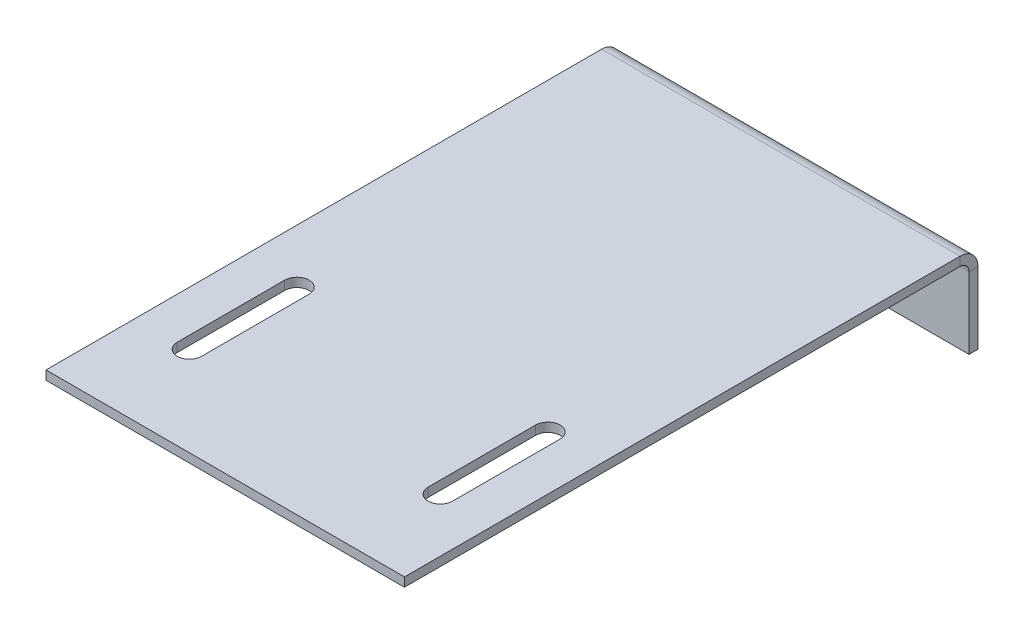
ISO-10303-21;
HEADER;
FILE_DESCRIPTION(('STEP AP214'),'2;1');
FILE_NAME('part.step','',(''),(''),'','','');
FILE_SCHEMA(('AUTOMOTIVE_DESIGN { 1 0 10303 214 1 1 1 1 }'));
ENDSEC;
DATA;
#1=APPLICATION_CONTEXT('core data for automotive mechanical design processes');
#2=APPLICATION_PROTOCOL_DEFINITION('international standard','automotive_design',2000,#1);
#3=PRODUCT_CONTEXT('',#1,'mechanical');
#4=PRODUCT('Part','Part','',(#3));
#5=PRODUCT_RELATED_PRODUCT_CATEGORY('part','',(#4));
#6=PRODUCT_DEFINITION_FORMATION('','',#4);
#7=PRODUCT_DEFINITION_CONTEXT('part definition',#1,'design');
#8=PRODUCT_DEFINITION('design','',#6,#7);
#9=PRODUCT_DEFINITION_SHAPE('','',#8);
#10=(LENGTH_UNIT() NAMED_UNIT(*) SI_UNIT(.MILLI.,.METRE.));
#11=(NAMED_UNIT(*) PLANE_ANGLE_UNIT() SI_UNIT($,.RADIAN.));
#12=(NAMED_UNIT(*) SI_UNIT($,.STERADIAN.) SOLID_ANGLE_UNIT());
#13=UNCERTAINTY_MEASURE_WITH_UNIT(LENGTH_MEASURE(1.E-05),#10,'distance_accuracy_value','');
#14=(GEOMETRIC_REPRESENTATION_CONTEXT(3) GLOBAL_UNCERTAINTY_ASSIGNED_CONTEXT((#13)) GLOBAL_UNIT_ASSIGNED_CONTEXT((#10,
#11,#12)) REPRESENTATION_CONTEXT('',''));
#15=CARTESIAN_POINT('',(0.,0.,0.));
#16=DIRECTION('',(0.,0.,1.));
#17=DIRECTION('',(1.,0.,0.));
#18=AXIS2_PLACEMENT_3D('',#15,#16,#17);
#19=CARTESIAN_POINT('',(50.,-5.,-160.));
#20=DIRECTION('',(1.,0.,0.));
#21=DIRECTION('',(0.,0.,-1.));
#22=AXIS2_PLACEMENT_3D('',#19,#20,#21);
#23=PLANE('',#22);
#24=DIRECTION('',(0.,0.,1.));
#25=VECTOR('',#24,1.);
#26=CARTESIAN_POINT('',(50.,-5.,-160.));
#27=LINE('',#26,#25);
#28=CARTESIAN_POINT('',(50.,-5.,-160.));
#29=VERTEX_POINT('',#28);
#30=CARTESIAN_POINT('',(50.,-5.,-157.5));
#31=VERTEX_POINT('',#30);
#32=EDGE_CURVE('E318',#29,#31,#27,.T.);
#33=ORIENTED_EDGE('',*,*,#32,.F.);
#34=CARTESIAN_POINT('',(50.,-5.,-155.));
#35=DIRECTION('',(1.,0.,0.));
#36=DIRECTION('',(0.,0.,-1.));
#37=AXIS2_PLACEMENT_3D('',#34,#35,#36);
#38=CIRCLE('',#37,5.);
#39=CARTESIAN_POINT('',(50.,0.,-155.));
#40=VERTEX_POINT('',#39);
#41=EDGE_CURVE('E262',#40,#29,#38,.F.);
#42=ORIENTED_EDGE('',*,*,#41,.F.);
#43=DIRECTION('',(0.,1.,0.));
#44=VECTOR('',#43,1.);
#45=CARTESIAN_POINT('',(50.,-2.50000000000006,-155.));
#46=LINE('',#45,#44);
#47=CARTESIAN_POINT('',(50.,-2.50000000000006,-155.));
#48=VERTEX_POINT('',#47);
#49=EDGE_CURVE('E315',#48,#40,#46,.T.);
#50=ORIENTED_EDGE('',*,*,#49,.F.);
#51=CARTESIAN_POINT('',(50.,-5.,-155.));
#52=DIRECTION('',(1.,0.,0.));
#53=DIRECTION('',(0.,0.,-1.));
#54=AXIS2_PLACEMENT_3D('',#51,#52,#53);
#55=CIRCLE('',#54,2.5);
#56=EDGE_CURVE('E277',#48,#31,#55,.F.);
#57=ORIENTED_EDGE('',*,*,#56,.T.);
#58=EDGE_LOOP('',(#33,#42,#50,#57));
#59=FACE_BOUND('',#58,.T.);
#60=ADVANCED_FACE('F42',(#59),#23,.T.);
#61=CARTESIAN_POINT('',(50.,-2.50000000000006,-155.));
#62=DIRECTION('',(1.,0.,0.));
#63=DIRECTION('',(0.,0.,-1.));
#64=AXIS2_PLACEMENT_3D('',#61,#62,#63);
#65=PLANE('',#64);
#66=DIRECTION('',(0.,-1.,0.));
#67=VECTOR('',#66,1.);
#68=CARTESIAN_POINT('',(50.,0.,-160.));
#69=LINE('',#68,#67);
#70=CARTESIAN_POINT('',(50.,-25.,-160.));
#71=VERTEX_POINT('',#70);
#72=EDGE_CURVE('E258',#29,#71,#69,.T.);
#73=ORIENTED_EDGE('',*,*,#72,.F.);
#74=ORIENTED_EDGE('',*,*,#32,.T.);
#75=DIRECTION('',(0.,1.,0.));
#76=VECTOR('',#75,1.);
#77=CARTESIAN_POINT('',(50.,0.,-157.5));
#78=LINE('',#77,#76);
#79=CARTESIAN_POINT('',(50.,-25.,-157.5));
#80=VERTEX_POINT('',#79);
#81=EDGE_CURVE('E251',#31,#80,#78,.F.);
#82=ORIENTED_EDGE('',*,*,#81,.T.);
#83=DIRECTION('',(0.,0.,1.));
#84=VECTOR('',#83,1.);
#85=CARTESIAN_POINT('',(50.,-25.,-160.));
#86=LINE('',#85,#84);
#87=EDGE_CURVE('E254',#71,#80,#86,.T.);
#88=ORIENTED_EDGE('',*,*,#87,.F.);
#89=EDGE_LOOP('',(#73,#74,#82,#88));
#90=FACE_BOUND('',#89,.T.);
#91=ADVANCED_FACE('F364',(#90),#65,.T.);
#92=CARTESIAN_POINT('',(-50.,0.,-155.));
#93=DIRECTION('',(-1.,0.,0.));
#94=DIRECTION('',(0.,0.,1.));
#95=AXIS2_PLACEMENT_3D('',#92,#93,#94);
#96=PLANE('',#95);
#97=DIRECTION('',(0.,-1.,0.));
#98=VECTOR('',#97,1.);
#99=CARTESIAN_POINT('',(-50.,0.,-155.));
#100=LINE('',#99,#98);
#101=CARTESIAN_POINT('',(-50.,0.,-155.));
#102=VERTEX_POINT('',#101);
#103=CARTESIAN_POINT('',(-50.,-2.50000000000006,-155.));
#104=VERTEX_POINT('',#103);
#105=EDGE_CURVE('E312',#102,#104,#100,.T.);
#106=ORIENTED_EDGE('',*,*,#105,.F.);
#107=CARTESIAN_POINT('',(-50.,-5.,-155.));
#108=DIRECTION('',(1.,0.,0.));
#109=DIRECTION('',(0.,0.,-1.));
#110=AXIS2_PLACEMENT_3D('',#107,#108,#109);
#111=CIRCLE('',#110,5.);
#112=CARTESIAN_POINT('',(-50.,-5.,-160.));
#113=VERTEX_POINT('',#112);
#114=EDGE_CURVE('E231',#102,#113,#111,.F.);
#115=ORIENTED_EDGE('',*,*,#114,.T.);
#116=DIRECTION('',(0.,0.,-1.));
#117=VECTOR('',#116,1.);
#118=CARTESIAN_POINT('',(-50.,-5.,-157.5));
#119=LINE('',#118,#117);
#120=CARTESIAN_POINT('',(-50.,-5.,-157.5));
#121=VERTEX_POINT('',#120);
#122=EDGE_CURVE('E309',#121,#113,#119,.T.);
#123=ORIENTED_EDGE('',*,*,#122,.F.);
#124=CARTESIAN_POINT('',(-50.,-5.,-155.));
#125=DIRECTION('',(1.,0.,0.));
#126=DIRECTION('',(0.,0.,-1.));
#127=AXIS2_PLACEMENT_3D('',#124,#125,#126);
#128=CIRCLE('',#127,2.5);
#129=EDGE_CURVE('E247',#104,#121,#128,.F.);
#130=ORIENTED_EDGE('',*,*,#129,.F.);
#131=EDGE_LOOP('',(#106,#115,#123,#130));
#132=FACE_BOUND('',#131,.T.);
#133=ADVANCED_FACE('F369',(#132),#96,.T.);
#134=CARTESIAN_POINT('',(-50.,-5.,-157.5));
#135=DIRECTION('',(-1.,0.,0.));
#136=DIRECTION('',(0.,0.,1.));
#137=AXIS2_PLACEMENT_3D('',#134,#135,#136);
#138=PLANE('',#137);
#139=DIRECTION('',(0.,0.,-1.));
#140=VECTOR('',#139,1.);
#141=CARTESIAN_POINT('',(-50.,0.,0.));
#142=LINE('',#141,#140);
#143=CARTESIAN_POINT('',(-50.,0.,0.));
#144=VERTEX_POINT('',#143);
#145=EDGE_CURVE('E235',#144,#102,#142,.T.);
#146=ORIENTED_EDGE('',*,*,#145,.T.);
#147=ORIENTED_EDGE('',*,*,#105,.T.);
#148=DIRECTION('',(0.,0.,-1.));
#149=VECTOR('',#148,1.);
#150=CARTESIAN_POINT('',(-50.,-2.50000000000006,0.));
#151=LINE('',#150,#149);
#152=CARTESIAN_POINT('',(-50.,-2.50000000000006,0.));
#153=VERTEX_POINT('',#152);
#154=EDGE_CURVE('E243',#153,#104,#151,.T.);
#155=ORIENTED_EDGE('',*,*,#154,.F.);
#156=DIRECTION('',(0.,1.,0.));
#157=VECTOR('',#156,1.);
#158=CARTESIAN_POINT('',(-50.,-2.50000000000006,0.));
#159=LINE('',#158,#157);
#160=EDGE_CURVE('E239',#153,#144,#159,.T.);
#161=ORIENTED_EDGE('',*,*,#160,.T.);
#162=EDGE_LOOP('',(#146,#147,#155,#161));
#163=FACE_BOUND('',#162,.T.);
#164=ADVANCED_FACE('F412',(#163),#138,.T.);
#165=CARTESIAN_POINT('',(50.,0.,-157.5));
#166=DIRECTION('',(0.,0.,-1.));
#167=DIRECTION('',(-1.,0.,0.));
#168=AXIS2_PLACEMENT_3D('',#165,#166,#167);
#169=PLANE('',#168);
#170=DIRECTION('',(0.,1.,0.));
#171=VECTOR('',#170,1.);
#172=CARTESIAN_POINT('',(-50.,0.,-157.5));
#173=LINE('',#172,#171);
#174=CARTESIAN_POINT('',(-50.,-25.,-157.5));
#175=VERTEX_POINT('',#174);
#176=EDGE_CURVE('E210',#121,#175,#173,.F.);
#177=ORIENTED_EDGE('',*,*,#176,.T.);
#178=DIRECTION('',(-1.,0.,0.));
#179=VECTOR('',#178,1.);
#180=CARTESIAN_POINT('',(50.,-25.,-157.5));
#181=LINE('',#180,#179);
#182=EDGE_CURVE('E306',#80,#175,#181,.T.);
#183=ORIENTED_EDGE('',*,*,#182,.F.);
#184=ORIENTED_EDGE('',*,*,#81,.F.);
#185=DIRECTION('',(-1.,0.,0.));
#186=VECTOR('',#185,1.);
#187=CARTESIAN_POINT('',(50.,-5.,-157.5));
#188=LINE('',#187,#186);
#189=EDGE_CURVE('E281',#31,#121,#188,.T.);
#190=ORIENTED_EDGE('',*,*,#189,.T.);
#191=EDGE_LOOP('',(#177,#183,#184,#190));
#192=FACE_BOUND('',#191,.T.);
#193=ADVANCED_FACE('F404',(#192),#169,.F.);
#194=CARTESIAN_POINT('',(50.,-25.,-160.));
#195=DIRECTION('',(0.,-1.,0.));
#196=DIRECTION('',(0.,0.,-1.));
#197=AXIS2_PLACEMENT_3D('',#194,#195,#196);
#198=PLANE('',#197);
#199=DIRECTION('',(0.,0.,1.));
#200=VECTOR('',#199,1.);
#201=CARTESIAN_POINT('',(-50.,-25.,-160.));
#202=LINE('',#201,#200);
#203=CARTESIAN_POINT('',(-50.,-25.,-160.));
#204=VERTEX_POINT('',#203);
#205=EDGE_CURVE('E223',#204,#175,#202,.T.);
#206=ORIENTED_EDGE('',*,*,#205,.F.);
#207=DIRECTION('',(-1.,0.,0.));
#208=VECTOR('',#207,1.);
#209=CARTESIAN_POINT('',(50.,-25.,-160.));
#210=LINE('',#209,#208);
#211=EDGE_CURVE('E303',#71,#204,#210,.T.);
#212=ORIENTED_EDGE('',*,*,#211,.F.);
#213=ORIENTED_EDGE('',*,*,#87,.T.);
#214=ORIENTED_EDGE('',*,*,#182,.T.);
#215=EDGE_LOOP('',(#206,#212,#213,#214));
#216=FACE_BOUND('',#215,.T.);
#217=ADVANCED_FACE('F407',(#216),#198,.T.);
#218=CARTESIAN_POINT('',(50.,0.,-160.));
#219=DIRECTION('',(0.,0.,-1.));
#220=DIRECTION('',(-1.,0.,0.));
#221=AXIS2_PLACEMENT_3D('',#218,#219,#220);
#222=PLANE('',#221);
#223=DIRECTION('',(0.,-1.,0.));
#224=VECTOR('',#223,1.);
#225=CARTESIAN_POINT('',(-50.,0.,-160.));
#226=LINE('',#225,#224);
#227=EDGE_CURVE('E227',#113,#204,#226,.T.);
#228=ORIENTED_EDGE('',*,*,#227,.F.);
#229=DIRECTION('',(-1.,0.,0.));
#230=VECTOR('',#229,1.);
#231=CARTESIAN_POINT('',(50.,-5.,-160.));
#232=LINE('',#231,#230);
#233=EDGE_CURVE('E299',#29,#113,#232,.T.);
#234=ORIENTED_EDGE('',*,*,#233,.F.);
#235=ORIENTED_EDGE('',*,*,#72,.T.);
#236=ORIENTED_EDGE('',*,*,#211,.T.);
#237=EDGE_LOOP('',(#228,#234,#235,#236));
#238=FACE_BOUND('',#237,.T.);
#239=ADVANCED_FACE('F378',(#238),#222,.T.);
#240=CARTESIAN_POINT('',(50.,-5.,-155.));
#241=DIRECTION('',(-1.,0.,0.));
#242=DIRECTION('',(0.,0.,1.));
#243=AXIS2_PLACEMENT_3D('',#240,#241,#242);
#244=CYLINDRICAL_SURFACE('',#243,5.);
#245=ORIENTED_EDGE('',*,*,#114,.F.);
#246=DIRECTION('',(-1.,0.,0.));
#247=VECTOR('',#246,1.);
#248=CARTESIAN_POINT('',(50.,0.,-155.));
#249=LINE('',#248,#247);
#250=EDGE_CURVE('E295',#40,#102,#249,.T.);
#251=ORIENTED_EDGE('',*,*,#250,.F.);
#252=ORIENTED_EDGE('',*,*,#41,.T.);
#253=ORIENTED_EDGE('',*,*,#233,.T.);
#254=EDGE_LOOP('',(#245,#251,#252,#253));
#255=FACE_BOUND('',#254,.T.);
#256=ADVANCED_FACE('F383',(#255),#244,.T.);
#257=CARTESIAN_POINT('',(50.,0.,0.));
#258=DIRECTION('',(0.,1.,0.));
#259=DIRECTION('',(0.,0.,1.));
#260=AXIS2_PLACEMENT_3D('',#257,#258,#259);
#261=PLANE('',#260);
#262=CARTESIAN_POINT('',(35.,0.,-55.));
#263=DIRECTION('',(0.,1.,0.));
#264=DIRECTION('',(0.,0.,-1.));
#265=AXIS2_PLACEMENT_3D('',#262,#263,#264);
#266=CIRCLE('',#265,3.4);
#267=CARTESIAN_POINT('',(38.4,0.,-55.));
#268=VERTEX_POINT('',#267);
#269=CARTESIAN_POINT('',(31.6,0.,-55.));
#270=VERTEX_POINT('',#269);
#271=EDGE_CURVE('E57',#268,#270,#266,.T.);
#272=ORIENTED_EDGE('',*,*,#271,.F.);
#273=DIRECTION('',(0.,0.,-1.));
#274=VECTOR('',#273,1.);
#275=CARTESIAN_POINT('',(38.4,0.,-55.));
#276=LINE('',#275,#274);
#277=CARTESIAN_POINT('',(38.4,0.,-25.));
#278=VERTEX_POINT('',#277);
#279=EDGE_CURVE('E176',#278,#268,#276,.T.);
#280=ORIENTED_EDGE('',*,*,#279,.F.);
#281=CARTESIAN_POINT('',(35.,0.,-25.));
#282=DIRECTION('',(0.,1.,0.));
#283=DIRECTION('',(0.,0.,1.));
#284=AXIS2_PLACEMENT_3D('',#281,#282,#283);
#285=CIRCLE('',#284,3.4);
#286=CARTESIAN_POINT('',(31.6,0.,-25.));
#287=VERTEX_POINT('',#286);
#288=EDGE_CURVE('E158',#287,#278,#285,.T.);
#289=ORIENTED_EDGE('',*,*,#288,.F.);
#290=DIRECTION('',(0.,0.,1.));
#291=VECTOR('',#290,1.);
#292=CARTESIAN_POINT('',(31.6,0.,-55.));
#293=LINE('',#292,#291);
#294=EDGE_CURVE('E168',#270,#287,#293,.T.);
#295=ORIENTED_EDGE('',*,*,#294,.F.);
#296=EDGE_LOOP('',(#272,#280,#289,#295));
#297=FACE_BOUND('',#296,.T.);
#298=CARTESIAN_POINT('',(-35.,0.,-25.));
#299=DIRECTION('',(0.,1.,0.));
#300=DIRECTION('',(0.,0.,-1.));
#301=AXIS2_PLACEMENT_3D('',#298,#299,#300);
#302=CIRCLE('',#301,3.4);
#303=CARTESIAN_POINT('',(-38.4,0.,-25.));
#304=VERTEX_POINT('',#303);
#305=CARTESIAN_POINT('',(-31.6,0.,-25.));
#306=VERTEX_POINT('',#305);
#307=EDGE_CURVE('E188',#304,#306,#302,.T.);
#308=ORIENTED_EDGE('',*,*,#307,.F.);
#309=DIRECTION('',(0.,0.,1.));
#310=VECTOR('',#309,1.);
#311=CARTESIAN_POINT('',(-38.4,0.,-25.));
#312=LINE('',#311,#310);
#313=CARTESIAN_POINT('',(-38.4,0.,-55.));
#314=VERTEX_POINT('',#313);
#315=EDGE_CURVE('E202',#314,#304,#312,.T.);
#316=ORIENTED_EDGE('',*,*,#315,.F.);
#317=CARTESIAN_POINT('',(-35.,0.,-55.));
#318=DIRECTION('',(0.,1.,0.));
#319=DIRECTION('',(0.,0.,1.));
#320=AXIS2_PLACEMENT_3D('',#317,#318,#319);
#321=CIRCLE('',#320,3.4);
#322=CARTESIAN_POINT('',(-31.6,0.,-55.));
#323=VERTEX_POINT('',#322);
#324=EDGE_CURVE('E198',#323,#314,#321,.T.);
#325=ORIENTED_EDGE('',*,*,#324,.F.);
#326=DIRECTION('',(0.,0.,-1.));
#327=VECTOR('',#326,1.);
#328=CARTESIAN_POINT('',(-31.6,0.,-25.));
#329=LINE('',#328,#327);
#330=EDGE_CURVE('E194',#306,#323,#329,.T.);
#331=ORIENTED_EDGE('',*,*,#330,.F.);
#332=EDGE_LOOP('',(#308,#316,#325,#331));
#333=FACE_BOUND('',#332,.T.);
#334=ORIENTED_EDGE('',*,*,#145,.F.);
#335=DIRECTION('',(-1.,0.,0.));
#336=VECTOR('',#335,1.);
#337=CARTESIAN_POINT('',(50.,0.,0.));
#338=LINE('',#337,#336);
#339=CARTESIAN_POINT('',(50.,0.,0.));
#340=VERTEX_POINT('',#339);
#341=EDGE_CURVE('E292',#340,#144,#338,.T.);
#342=ORIENTED_EDGE('',*,*,#341,.F.);
#343=DIRECTION('',(0.,0.,-1.));
#344=VECTOR('',#343,1.);
#345=CARTESIAN_POINT('',(50.,0.,0.));
#346=LINE('',#345,#344);
#347=EDGE_CURVE('E266',#340,#40,#346,.T.);
#348=ORIENTED_EDGE('',*,*,#347,.T.);
#349=ORIENTED_EDGE('',*,*,#250,.T.);
#350=EDGE_LOOP('',(#334,#342,#348,#349));
#351=FACE_BOUND('',#350,.T.);
#352=ADVANCED_FACE('F173',(#297,#333,#351),#261,.T.);
#353=CARTESIAN_POINT('',(50.,-2.50000000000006,0.));
#354=DIRECTION('',(0.,0.,1.));
#355=DIRECTION('',(1.,0.,0.));
#356=AXIS2_PLACEMENT_3D('',#353,#354,#355);
#357=PLANE('',#356);
#358=ORIENTED_EDGE('',*,*,#160,.F.);
#359=DIRECTION('',(-1.,0.,0.));
#360=VECTOR('',#359,1.);
#361=CARTESIAN_POINT('',(50.,-2.50000000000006,0.));
#362=LINE('',#361,#360);
#363=CARTESIAN_POINT('',(50.,-2.50000000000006,0.));
#364=VERTEX_POINT('',#363);
#365=EDGE_CURVE('E289',#364,#153,#362,.T.);
#366=ORIENTED_EDGE('',*,*,#365,.F.);
#367=DIRECTION('',(0.,1.,0.));
#368=VECTOR('',#367,1.);
#369=CARTESIAN_POINT('',(50.,-2.50000000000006,0.));
#370=LINE('',#369,#368);
#371=EDGE_CURVE('E270',#364,#340,#370,.T.);
#372=ORIENTED_EDGE('',*,*,#371,.T.);
#373=ORIENTED_EDGE('',*,*,#341,.T.);
#374=EDGE_LOOP('',(#358,#366,#372,#373));
#375=FACE_BOUND('',#374,.T.);
#376=ADVANCED_FACE('F392',(#375),#357,.T.);
#377=CARTESIAN_POINT('',(50.,-2.50000000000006,0.));
#378=DIRECTION('',(0.,1.,0.));
#379=DIRECTION('',(0.,0.,1.));
#380=AXIS2_PLACEMENT_3D('',#377,#378,#379);
#381=PLANE('',#380);
#382=DIRECTION('',(0.,0.,-1.));
#383=VECTOR('',#382,1.);
#384=CARTESIAN_POINT('',(38.4,-2.50000000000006,0.));
#385=LINE('',#384,#383);
#386=CARTESIAN_POINT('',(38.4,-2.50000000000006,-25.));
#387=VERTEX_POINT('',#386);
#388=CARTESIAN_POINT('',(38.4,-2.50000000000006,-55.));
#389=VERTEX_POINT('',#388);
#390=EDGE_CURVE('E50',#387,#389,#385,.T.);
#391=ORIENTED_EDGE('',*,*,#390,.T.);
#392=CARTESIAN_POINT('',(35.,-2.50000000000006,-55.));
#393=DIRECTION('',(0.,1.,0.));
#394=DIRECTION('',(0.,0.,1.));
#395=AXIS2_PLACEMENT_3D('',#392,#393,#394);
#396=CIRCLE('',#395,3.4);
#397=CARTESIAN_POINT('',(31.6,-2.50000000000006,-55.));
#398=VERTEX_POINT('',#397);
#399=EDGE_CURVE('E11',#389,#398,#396,.T.);
#400=ORIENTED_EDGE('',*,*,#399,.T.);
#401=DIRECTION('',(0.,0.,1.));
#402=VECTOR('',#401,1.);
#403=CARTESIAN_POINT('',(31.6,-2.50000000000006,0.));
#404=LINE('',#403,#402);
#405=CARTESIAN_POINT('',(31.6,-2.50000000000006,-25.));
#406=VERTEX_POINT('',#405);
#407=EDGE_CURVE('E337',#398,#406,#404,.T.);
#408=ORIENTED_EDGE('',*,*,#407,.T.);
#409=CARTESIAN_POINT('',(35.,-2.50000000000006,-25.));
#410=DIRECTION('',(0.,1.,0.));
#411=DIRECTION('',(0.,0.,1.));
#412=AXIS2_PLACEMENT_3D('',#409,#410,#411);
#413=CIRCLE('',#412,3.4);
#414=EDGE_CURVE('E161',#406,#387,#413,.T.);
#415=ORIENTED_EDGE('',*,*,#414,.T.);
#416=EDGE_LOOP('',(#391,#400,#408,#415));
#417=FACE_BOUND('',#416,.T.);
#418=DIRECTION('',(0.,0.,1.));
#419=VECTOR('',#418,1.);
#420=CARTESIAN_POINT('',(-38.4,-2.50000000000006,0.));
#421=LINE('',#420,#419);
#422=CARTESIAN_POINT('',(-38.4,-2.50000000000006,-55.));
#423=VERTEX_POINT('',#422);
#424=CARTESIAN_POINT('',(-38.4,-2.50000000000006,-25.));
#425=VERTEX_POINT('',#424);
#426=EDGE_CURVE('E329',#423,#425,#421,.T.);
#427=ORIENTED_EDGE('',*,*,#426,.T.);
#428=CARTESIAN_POINT('',(-35.,-2.50000000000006,-25.));
#429=DIRECTION('',(0.,1.,0.));
#430=DIRECTION('',(0.,0.,1.));
#431=AXIS2_PLACEMENT_3D('',#428,#429,#430);
#432=CIRCLE('',#431,3.4);
#433=CARTESIAN_POINT('',(-31.6,-2.50000000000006,-25.));
#434=VERTEX_POINT('',#433);
#435=EDGE_CURVE('E333',#425,#434,#432,.T.);
#436=ORIENTED_EDGE('',*,*,#435,.T.);
#437=DIRECTION('',(0.,0.,-1.));
#438=VECTOR('',#437,1.);
#439=CARTESIAN_POINT('',(-31.6,-2.50000000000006,0.));
#440=LINE('',#439,#438);
#441=CARTESIAN_POINT('',(-31.6,-2.50000000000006,-55.));
#442=VERTEX_POINT('',#441);
#443=EDGE_CURVE('E321',#434,#442,#440,.T.);
#444=ORIENTED_EDGE('',*,*,#443,.T.);
#445=CARTESIAN_POINT('',(-35.,-2.50000000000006,-55.));
#446=DIRECTION('',(0.,1.,0.));
#447=DIRECTION('',(0.,0.,1.));
#448=AXIS2_PLACEMENT_3D('',#445,#446,#447);
#449=CIRCLE('',#448,3.4);
#450=EDGE_CURVE('E325',#442,#423,#449,.T.);
#451=ORIENTED_EDGE('',*,*,#450,.T.);
#452=EDGE_LOOP('',(#427,#436,#444,#451));
#453=FACE_BOUND('',#452,.T.);
#454=ORIENTED_EDGE('',*,*,#154,.T.);
#455=DIRECTION('',(-1.,0.,0.));
#456=VECTOR('',#455,1.);
#457=CARTESIAN_POINT('',(50.,-2.50000000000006,-155.));
#458=LINE('',#457,#456);
#459=EDGE_CURVE('E285',#48,#104,#458,.T.);
#460=ORIENTED_EDGE('',*,*,#459,.F.);
#461=DIRECTION('',(0.,0.,-1.));
#462=VECTOR('',#461,1.);
#463=CARTESIAN_POINT('',(50.,-2.50000000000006,0.));
#464=LINE('',#463,#462);
#465=EDGE_CURVE('E274',#364,#48,#464,.T.);
#466=ORIENTED_EDGE('',*,*,#465,.F.);
#467=ORIENTED_EDGE('',*,*,#365,.T.);
#468=EDGE_LOOP('',(#454,#460,#466,#467));
#469=FACE_BOUND('',#468,.T.);
#470=ADVANCED_FACE('F344',(#417,#453,#469),#381,.F.);
#471=CARTESIAN_POINT('',(50.,-5.,-155.));
#472=DIRECTION('',(-1.,0.,0.));
#473=DIRECTION('',(0.,0.,1.));
#474=AXIS2_PLACEMENT_3D('',#471,#472,#473);
#475=CYLINDRICAL_SURFACE('',#474,2.5);
#476=ORIENTED_EDGE('',*,*,#129,.T.);
#477=ORIENTED_EDGE('',*,*,#189,.F.);
#478=ORIENTED_EDGE('',*,*,#56,.F.);
#479=ORIENTED_EDGE('',*,*,#459,.T.);
#480=EDGE_LOOP('',(#476,#477,#478,#479));
#481=FACE_BOUND('',#480,.T.);
#482=ADVANCED_FACE('F399',(#481),#475,.F.);
#483=CARTESIAN_POINT('',(50.,-5.,-155.));
#484=DIRECTION('',(1.,0.,0.));
#485=DIRECTION('',(0.,0.,-1.));
#486=AXIS2_PLACEMENT_3D('',#483,#484,#485);
#487=PLANE('',#486);
#488=ORIENTED_EDGE('',*,*,#465,.T.);
#489=ORIENTED_EDGE('',*,*,#49,.T.);
#490=ORIENTED_EDGE('',*,*,#347,.F.);
#491=ORIENTED_EDGE('',*,*,#371,.F.);
#492=EDGE_LOOP('',(#488,#489,#490,#491));
#493=FACE_BOUND('',#492,.T.);
#494=ADVANCED_FACE('F389',(#493),#487,.T.);
#495=CARTESIAN_POINT('',(-50.,-5.,-155.));
#496=DIRECTION('',(1.,0.,0.));
#497=DIRECTION('',(0.,0.,-1.));
#498=AXIS2_PLACEMENT_3D('',#495,#496,#497);
#499=PLANE('',#498);
#500=ORIENTED_EDGE('',*,*,#176,.F.);
#501=ORIENTED_EDGE('',*,*,#122,.T.);
#502=ORIENTED_EDGE('',*,*,#227,.T.);
#503=ORIENTED_EDGE('',*,*,#205,.T.);
#504=EDGE_LOOP('',(#500,#501,#502,#503));
#505=FACE_BOUND('',#504,.T.);
#506=ADVANCED_FACE('F409',(#505),#499,.F.);
#507=CARTESIAN_POINT('',(-35.,-10.,-25.));
#508=DIRECTION('',(0.,1.,0.));
#509=DIRECTION('',(0.,0.,1.));
#510=AXIS2_PLACEMENT_3D('',#507,#508,#509);
#511=CYLINDRICAL_SURFACE('',#510,3.4);
#512=DIRECTION('',(0.,1.,0.));
#513=VECTOR('',#512,1.);
#514=CARTESIAN_POINT('',(-38.4,-10.,-25.));
#515=LINE('',#514,#513);
#516=EDGE_CURVE('E207',#425,#304,#515,.T.);
#517=ORIENTED_EDGE('',*,*,#516,.T.);
#518=ORIENTED_EDGE('',*,*,#307,.T.);
#519=DIRECTION('',(0.,1.,0.));
#520=VECTOR('',#519,1.);
#521=CARTESIAN_POINT('',(-31.6,-10.,-25.));
#522=LINE('',#521,#520);
#523=EDGE_CURVE('E206',#434,#306,#522,.T.);
#524=ORIENTED_EDGE('',*,*,#523,.F.);
#525=ORIENTED_EDGE('',*,*,#435,.F.);
#526=EDGE_LOOP('',(#517,#518,#524,#525));
#527=FACE_BOUND('',#526,.T.);
#528=ADVANCED_FACE('F440',(#527),#511,.F.);
#529=CARTESIAN_POINT('',(-38.4,-10.,-25.));
#530=DIRECTION('',(-1.,0.,0.));
#531=DIRECTION('',(0.,0.,1.));
#532=AXIS2_PLACEMENT_3D('',#529,#530,#531);
#533=PLANE('',#532);
#534=DIRECTION('',(0.,1.,0.));
#535=VECTOR('',#534,1.);
#536=CARTESIAN_POINT('',(-38.4,-10.,-55.));
#537=LINE('',#536,#535);
#538=EDGE_CURVE('E211',#423,#314,#537,.T.);
#539=ORIENTED_EDGE('',*,*,#538,.T.);
#540=ORIENTED_EDGE('',*,*,#315,.T.);
#541=ORIENTED_EDGE('',*,*,#516,.F.);
#542=ORIENTED_EDGE('',*,*,#426,.F.);
#543=EDGE_LOOP('',(#539,#540,#541,#542));
#544=FACE_BOUND('',#543,.T.);
#545=ADVANCED_FACE('F442',(#544),#533,.F.);
#546=CARTESIAN_POINT('',(-35.,-10.,-55.));
#547=DIRECTION('',(0.,1.,0.));
#548=DIRECTION('',(0.,0.,1.));
#549=AXIS2_PLACEMENT_3D('',#546,#547,#548);
#550=CYLINDRICAL_SURFACE('',#549,3.4);
#551=DIRECTION('',(0.,1.,0.));
#552=VECTOR('',#551,1.);
#553=CARTESIAN_POINT('',(-31.6,-10.,-55.));
#554=LINE('',#553,#552);
#555=EDGE_CURVE('E214',#442,#323,#554,.T.);
#556=ORIENTED_EDGE('',*,*,#555,.T.);
#557=ORIENTED_EDGE('',*,*,#324,.T.);
#558=ORIENTED_EDGE('',*,*,#538,.F.);
#559=ORIENTED_EDGE('',*,*,#450,.F.);
#560=EDGE_LOOP('',(#556,#557,#558,#559));
#561=FACE_BOUND('',#560,.T.);
#562=ADVANCED_FACE('F358',(#561),#550,.F.);
#563=CARTESIAN_POINT('',(-31.6,-10.,-25.));
#564=DIRECTION('',(1.,0.,0.));
#565=DIRECTION('',(0.,0.,-1.));
#566=AXIS2_PLACEMENT_3D('',#563,#564,#565);
#567=PLANE('',#566);
#568=ORIENTED_EDGE('',*,*,#523,.T.);
#569=ORIENTED_EDGE('',*,*,#330,.T.);
#570=ORIENTED_EDGE('',*,*,#555,.F.);
#571=ORIENTED_EDGE('',*,*,#443,.F.);
#572=EDGE_LOOP('',(#568,#569,#570,#571));
#573=FACE_BOUND('',#572,.T.);
#574=ADVANCED_FACE('F351',(#573),#567,.F.);
#575=CARTESIAN_POINT('',(35.,-10.,-55.));
#576=DIRECTION('',(0.,1.,0.));
#577=DIRECTION('',(0.,0.,1.));
#578=AXIS2_PLACEMENT_3D('',#575,#576,#577);
#579=CYLINDRICAL_SURFACE('',#578,3.4);
#580=DIRECTION('',(0.,1.,0.));
#581=VECTOR('',#580,1.);
#582=CARTESIAN_POINT('',(38.4,-10.,-55.));
#583=LINE('',#582,#581);
#584=EDGE_CURVE('E185',#389,#268,#583,.T.);
#585=ORIENTED_EDGE('',*,*,#584,.T.);
#586=ORIENTED_EDGE('',*,*,#271,.T.);
#587=DIRECTION('',(0.,1.,0.));
#588=VECTOR('',#587,1.);
#589=CARTESIAN_POINT('',(31.6,-10.,-55.));
#590=LINE('',#589,#588);
#591=EDGE_CURVE('E165',#398,#270,#590,.T.);
#592=ORIENTED_EDGE('',*,*,#591,.F.);
#593=ORIENTED_EDGE('',*,*,#399,.F.);
#594=EDGE_LOOP('',(#585,#586,#592,#593));
#595=FACE_BOUND('',#594,.T.);
#596=ADVANCED_FACE('F349',(#595),#579,.F.);
#597=CARTESIAN_POINT('',(38.4,-10.,-55.));
#598=DIRECTION('',(1.,0.,0.));
#599=DIRECTION('',(0.,0.,-1.));
#600=AXIS2_PLACEMENT_3D('',#597,#598,#599);
#601=PLANE('',#600);
#602=DIRECTION('',(0.,1.,0.));
#603=VECTOR('',#602,1.);
#604=CARTESIAN_POINT('',(38.4,-10.,-25.));
#605=LINE('',#604,#603);
#606=EDGE_CURVE('E164',#387,#278,#605,.T.);
#607=ORIENTED_EDGE('',*,*,#606,.T.);
#608=ORIENTED_EDGE('',*,*,#279,.T.);
#609=ORIENTED_EDGE('',*,*,#584,.F.);
#610=ORIENTED_EDGE('',*,*,#390,.F.);
#611=EDGE_LOOP('',(#607,#608,#609,#610));
#612=FACE_BOUND('',#611,.T.);
#613=ADVANCED_FACE('F348',(#612),#601,.F.);
#614=CARTESIAN_POINT('',(35.,-10.,-25.));
#615=DIRECTION('',(0.,1.,0.));
#616=DIRECTION('',(0.,0.,1.));
#617=AXIS2_PLACEMENT_3D('',#614,#615,#616);
#618=CYLINDRICAL_SURFACE('',#617,3.4);
#619=DIRECTION('',(0.,1.,0.));
#620=VECTOR('',#619,1.);
#621=CARTESIAN_POINT('',(31.6,-10.,-25.));
#622=LINE('',#621,#620);
#623=EDGE_CURVE('E65',#406,#287,#622,.T.);
#624=ORIENTED_EDGE('',*,*,#623,.T.);
#625=ORIENTED_EDGE('',*,*,#288,.T.);
#626=ORIENTED_EDGE('',*,*,#606,.F.);
#627=ORIENTED_EDGE('',*,*,#414,.F.);
#628=EDGE_LOOP('',(#624,#625,#626,#627));
#629=FACE_BOUND('',#628,.T.);
#630=ADVANCED_FACE('F155',(#629),#618,.F.);
#631=CARTESIAN_POINT('',(31.6,-10.,-55.));
#632=DIRECTION('',(-1.,0.,0.));
#633=DIRECTION('',(0.,0.,1.));
#634=AXIS2_PLACEMENT_3D('',#631,#632,#633);
#635=PLANE('',#634);
#636=ORIENTED_EDGE('',*,*,#591,.T.);
#637=ORIENTED_EDGE('',*,*,#294,.T.);
#638=ORIENTED_EDGE('',*,*,#623,.F.);
#639=ORIENTED_EDGE('',*,*,#407,.F.);
#640=EDGE_LOOP('',(#636,#637,#638,#639));
#641=FACE_BOUND('',#640,.T.);
#642=ADVANCED_FACE('F169',(#641),#635,.F.);
#643=CLOSED_SHELL('',(#60,#91,#133,#164,#193,#217,#239,#256,#352,#376,#470,#482,#494,#506,#528,
#545,#562,#574,#596,#613,#630,#642));
#644=MANIFOLD_SOLID_BREP('B2',#643);
#645=ADVANCED_BREP_SHAPE_REPRESENTATION('',(#18,#644),#14);
#646=SHAPE_DEFINITION_REPRESENTATION(#9,#645);
ENDSEC;
END-ISO-10303-21;
